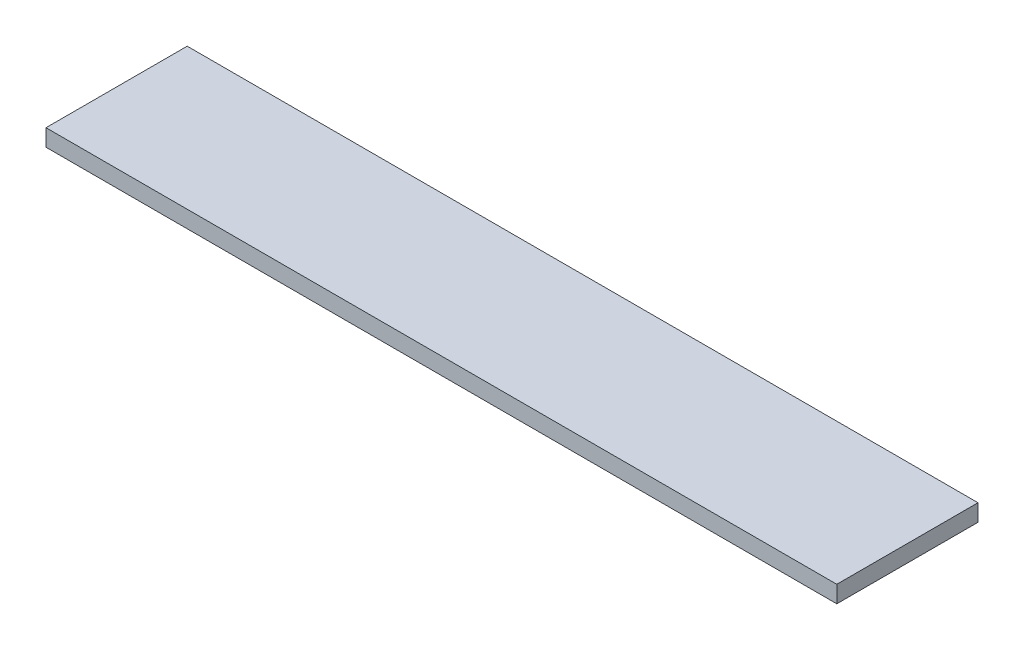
from build123d import *

# Parameters (mm, degrees)
SKETCH1_W           = 280
SKETCH1_H           = 50
BOSS_EXTRUDE1_DEPTH = 6


with BuildPart() as part:
    # Sketch1 → Boss-Extrude1 (new body)
    with BuildSketch(Plane(origin=(0, 0, 0), x_dir=(1, 0, 0), z_dir=(0, 1, 0))):
        with Locations((140, 25)):
            Rectangle(SKETCH1_W, SKETCH1_H)
    extrude(amount=BOSS_EXTRUDE1_DEPTH)


solid = part.part
